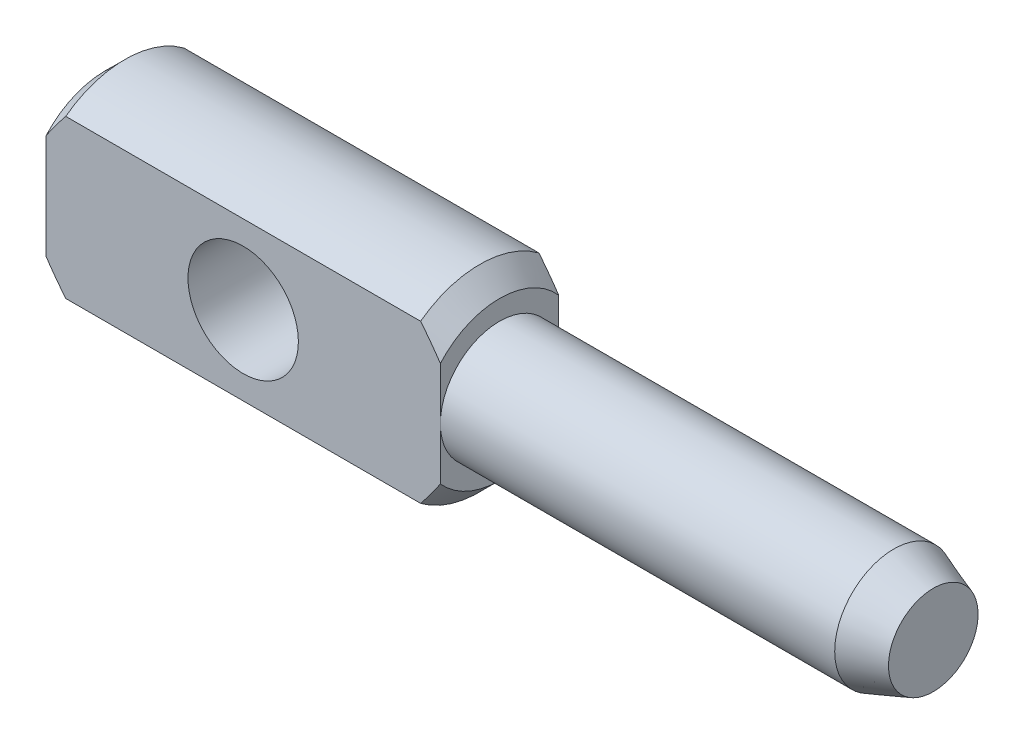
ISO-10303-21;
HEADER;
FILE_DESCRIPTION(('STEP AP214'),'2;1');
FILE_NAME('part.step','',(''),(''),'','','');
FILE_SCHEMA(('AUTOMOTIVE_DESIGN { 1 0 10303 214 1 1 1 1 }'));
ENDSEC;
DATA;
#1=APPLICATION_CONTEXT('core data for automotive mechanical design processes');
#2=APPLICATION_PROTOCOL_DEFINITION('international standard','automotive_design',2000,#1);
#3=PRODUCT_CONTEXT('',#1,'mechanical');
#4=PRODUCT('Part','Part','',(#3));
#5=PRODUCT_RELATED_PRODUCT_CATEGORY('part','',(#4));
#6=PRODUCT_DEFINITION_FORMATION('','',#4);
#7=PRODUCT_DEFINITION_CONTEXT('part definition',#1,'design');
#8=PRODUCT_DEFINITION('design','',#6,#7);
#9=PRODUCT_DEFINITION_SHAPE('','',#8);
#10=(LENGTH_UNIT() NAMED_UNIT(*) SI_UNIT(.MILLI.,.METRE.));
#11=(NAMED_UNIT(*) PLANE_ANGLE_UNIT() SI_UNIT($,.RADIAN.));
#12=(NAMED_UNIT(*) SI_UNIT($,.STERADIAN.) SOLID_ANGLE_UNIT());
#13=UNCERTAINTY_MEASURE_WITH_UNIT(LENGTH_MEASURE(1.E-05),#10,'distance_accuracy_value','');
#14=(GEOMETRIC_REPRESENTATION_CONTEXT(3) GLOBAL_UNCERTAINTY_ASSIGNED_CONTEXT((#13)) GLOBAL_UNIT_ASSIGNED_CONTEXT((#10,
#11,#12)) REPRESENTATION_CONTEXT('',''));
#15=CARTESIAN_POINT('',(0.,0.,0.));
#16=DIRECTION('',(0.,0.,1.));
#17=DIRECTION('',(1.,0.,0.));
#18=AXIS2_PLACEMENT_3D('',#15,#16,#17);
#19=CARTESIAN_POINT('',(0.,0.,0.));
#20=DIRECTION('',(1.,0.,0.));
#21=DIRECTION('',(0.,0.,-1.));
#22=AXIS2_PLACEMENT_3D('',#19,#20,#21);
#23=PLANE('',#22);
#24=DIRECTION('',(0.,1.,0.));
#25=VECTOR('',#24,1.);
#26=CARTESIAN_POINT('',(0.,-2.5,1.5));
#27=LINE('',#26,#25);
#28=CARTESIAN_POINT('',(0.,-1.32287565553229,1.5));
#29=VERTEX_POINT('',#28);
#30=CARTESIAN_POINT('',(0.,1.3228756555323,1.5));
#31=VERTEX_POINT('',#30);
#32=EDGE_CURVE('E116',#29,#31,#27,.T.);
#33=ORIENTED_EDGE('',*,*,#32,.T.);
#34=CARTESIAN_POINT('',(0.,0.,0.));
#35=DIRECTION('',(-1.,0.,0.));
#36=DIRECTION('',(0.,0.,1.));
#37=AXIS2_PLACEMENT_3D('',#34,#35,#36);
#38=CIRCLE('',#37,2.);
#39=CARTESIAN_POINT('',(0.,1.3228756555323,-1.5));
#40=VERTEX_POINT('',#39);
#41=EDGE_CURVE('E12',#31,#40,#38,.T.);
#42=ORIENTED_EDGE('',*,*,#41,.T.);
#43=DIRECTION('',(0.,-1.,0.));
#44=VECTOR('',#43,1.);
#45=CARTESIAN_POINT('',(0.,-2.5,-1.5));
#46=LINE('',#45,#44);
#47=CARTESIAN_POINT('',(0.,-1.3228756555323,-1.5));
#48=VERTEX_POINT('',#47);
#49=EDGE_CURVE('E104',#40,#48,#46,.T.);
#50=ORIENTED_EDGE('',*,*,#49,.T.);
#51=EDGE_CURVE('E42',#48,#29,#38,.T.);
#52=ORIENTED_EDGE('',*,*,#51,.T.);
#53=EDGE_LOOP('',(#33,#42,#50,#52));
#54=FACE_BOUND('',#53,.T.);
#55=ADVANCED_FACE('F35',(#54),#23,.F.);
#56=CARTESIAN_POINT('',(0.5,0.,0.));
#57=DIRECTION('',(1.,0.,0.));
#58=DIRECTION('',(0.,0.,-1.));
#59=AXIS2_PLACEMENT_3D('',#56,#57,#58);
#60=CONICAL_SURFACE('',#59,2.5,0.785398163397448);
#61=CARTESIAN_POINT('',(3.51516268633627,5.30726101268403,1.5));
#62=CARTESIAN_POINT('',(3.41129820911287,5.19932456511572,1.5));
#63=CARTESIAN_POINT('',(3.30755186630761,5.09127425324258,1.5));
#64=CARTESIAN_POINT('',(3.10035188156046,4.87489153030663,1.5));
#65=CARTESIAN_POINT('',(2.9968982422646,4.76655911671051,1.5));
#66=CARTESIAN_POINT('',(2.68699795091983,4.4409908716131,1.5));
#67=CARTESIAN_POINT('',(2.48107825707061,4.22325282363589,1.5));
#68=CARTESIAN_POINT('',(2.07285908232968,3.78735533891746,1.5));
#69=CARTESIAN_POINT('',(1.87054417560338,3.56921041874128,1.5));
#70=CARTESIAN_POINT('',(1.5697300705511,3.2395911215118,1.5));
#71=CARTESIAN_POINT('',(1.4699081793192,3.12932498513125,1.5));
#72=CARTESIAN_POINT('',(1.27145616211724,2.9077267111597,1.5));
#73=CARTESIAN_POINT('',(1.17282600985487,2.79639459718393,1.5));
#74=CARTESIAN_POINT('',(1.00543413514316,2.60463800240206,1.5));
#75=CARTESIAN_POINT('',(0.936267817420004,2.52456708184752,1.5));
#76=CARTESIAN_POINT('',(0.798998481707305,2.36350815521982,1.5));
#77=CARTESIAN_POINT('',(0.7308955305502,2.28252009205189,1.5));
#78=CARTESIAN_POINT('',(0.595778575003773,2.11900885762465,1.5));
#79=CARTESIAN_POINT('',(0.528771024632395,2.03648033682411,1.5));
#80=CARTESIAN_POINT('',(0.396669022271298,1.86991949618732,1.5));
#81=CARTESIAN_POINT('',(0.331574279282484,1.78588740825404,1.5));
#82=CARTESIAN_POINT('',(0.203522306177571,1.6151567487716,1.5));
#83=CARTESIAN_POINT('',(0.140586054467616,1.52844234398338,1.5));
#84=CARTESIAN_POINT('',(0.0185337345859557,1.3522307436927,1.5));
#85=CARTESIAN_POINT('',(-0.0405793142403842,1.2627314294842,1.5));
#86=CARTESIAN_POINT('',(-0.152775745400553,1.08045990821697,1.5));
#87=CARTESIAN_POINT('',(-0.205881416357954,0.987701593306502,1.5));
#88=CARTESIAN_POINT('',(-0.303093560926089,0.79758711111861,1.5));
#89=CARTESIAN_POINT('',(-0.347216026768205,0.700239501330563,1.5));
#90=CARTESIAN_POINT('',(-0.403299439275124,0.549256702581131,1.5));
#91=CARTESIAN_POINT('',(-0.42043059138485,0.497552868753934,1.5));
#92=CARTESIAN_POINT('',(-0.450219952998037,0.392856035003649,1.5));
#93=CARTESIAN_POINT('',(-0.462878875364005,0.339863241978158,1.5));
#94=CARTESIAN_POINT('',(-0.482866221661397,0.233262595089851,1.5));
#95=CARTESIAN_POINT('',(-0.490232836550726,0.179662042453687,1.5));
#96=CARTESIAN_POINT('',(-0.499231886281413,0.0719778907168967,1.5));
#97=CARTESIAN_POINT('',(-0.500865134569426,0.017894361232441,1.5));
#98=CARTESIAN_POINT('',(-0.498261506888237,-0.0902887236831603,1.5));
#99=CARTESIAN_POINT('',(-0.494007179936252,-0.144387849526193,1.5));
#100=CARTESIAN_POINT('',(-0.479938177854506,-0.25185285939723,1.5));
#101=CARTESIAN_POINT('',(-0.470122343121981,-0.305218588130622,1.5));
#102=CARTESIAN_POINT('',(-0.445517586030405,-0.411215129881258,1.5));
#103=CARTESIAN_POINT('',(-0.430689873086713,-0.463836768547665,1.5));
#104=CARTESIAN_POINT('',(-0.396911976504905,-0.567720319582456,1.5));
#105=CARTESIAN_POINT('',(-0.377961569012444,-0.618982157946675,1.5));
#106=CARTESIAN_POINT('',(-0.332968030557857,-0.729371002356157,1.5));
#107=CARTESIAN_POINT('',(-0.306261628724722,-0.788225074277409,1.5));
#108=CARTESIAN_POINT('',(-0.249281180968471,-0.904194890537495,1.5));
#109=CARTESIAN_POINT('',(-0.219005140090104,-0.961309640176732,1.5));
#110=CARTESIAN_POINT('',(-0.155680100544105,-1.07410361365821,1.5));
#111=CARTESIAN_POINT('',(-0.122626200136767,-1.12978006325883,1.5));
#112=CARTESIAN_POINT('',(-0.0544093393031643,-1.23983114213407,1.5));
#113=CARTESIAN_POINT('',(-0.0192459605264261,-1.29420551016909,1.5));
#114=CARTESIAN_POINT('',(0.0894442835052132,-1.45683639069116,1.5));
#115=CARTESIAN_POINT('',(0.16547784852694,-1.56341309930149,1.5));
#116=CARTESIAN_POINT('',(0.321582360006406,-1.77330825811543,1.5));
#117=CARTESIAN_POINT('',(0.401648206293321,-1.87663056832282,1.5));
#118=CARTESIAN_POINT('',(0.543618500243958,-2.05477163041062,1.5));
#119=CARTESIAN_POINT('',(0.604899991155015,-2.13008914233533,1.5));
#120=CARTESIAN_POINT('',(0.728642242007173,-2.27974903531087,1.5));
#121=CARTESIAN_POINT('',(0.791103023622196,-2.354091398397,1.5));
#122=CARTESIAN_POINT('',(0.979863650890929,-2.57598067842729,1.5));
#123=CARTESIAN_POINT('',(1.10752448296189,-2.72236841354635,1.5));
#124=CARTESIAN_POINT('',(1.36529460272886,-3.01325594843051,1.5));
#125=CARTESIAN_POINT('',(1.49540651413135,-3.15775340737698,1.5));
#126=CARTESIAN_POINT('',(1.75719842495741,-3.44529728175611,1.5));
#127=CARTESIAN_POINT('',(1.88887829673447,-3.58834381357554,1.5));
#128=CARTESIAN_POINT('',(2.14434448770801,-3.86368160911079,1.5));
#129=CARTESIAN_POINT('',(2.26805709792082,-3.99604140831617,1.5));
#130=CARTESIAN_POINT('',(2.51621722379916,-4.2600760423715,1.5));
#131=CARTESIAN_POINT('',(2.64066475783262,-4.3917508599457,1.5));
#132=CARTESIAN_POINT('',(2.88987319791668,-4.65430649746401,1.5));
#133=CARTESIAN_POINT('',(3.0146329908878,-4.7851883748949,1.5));
#134=CARTESIAN_POINT('',(3.26459391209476,-5.04652082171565,1.5));
#135=CARTESIAN_POINT('',(3.38979502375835,-5.17697140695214,1.5));
#136=CARTESIAN_POINT('',(3.51516268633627,-5.30726101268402,1.5));
#137=B_SPLINE_CURVE_WITH_KNOTS('',3,(#61,#62,#63,#64,#65,#66,#67,#68,#69,#70,#71,#72,#73,#74,
#75,#76,#77,#78,#79,#80,#81,#82,#83,#84,#85,#86,#87,#88,#89,#90,#91,#92,#93,#94,#95,#96,#97,#98,
#99,#100,#101,#102,#103,#104,#105,#106,#107,#108,#109,#110,#111,#112,#113,#114,#115,#116,#117,
#118,#119,#120,#121,#122,#123,#124,#125,#126,#127,#128,#129,#130,#131,#132,#133,#134,#135,#136),
.UNSPECIFIED.,.F.,.F.,(4,2,2,2,2,2,2,2,2,2,2,2,2,2,2,2,2,2,2,2,2,2,2,2,2,2,2,2,2,2,2,2,2,2,2,2,
2,4),(0.,0.449380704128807,0.898765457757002,1.79782163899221,2.69035548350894,3.13656410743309,
3.58276286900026,3.90017989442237,4.21761678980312,4.53651459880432,4.85536363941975,
5.1767345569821,5.49835625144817,5.81874255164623,6.13855340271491,6.30179762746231,
6.46501581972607,6.6270440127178,6.78904921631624,6.95153563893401,7.11405595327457,
7.27786408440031,7.44168111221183,7.6354096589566,7.82924699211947,8.02343385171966,
8.21765935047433,8.61022782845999,9.00231166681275,9.29359301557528,9.58487972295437,
10.1675355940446,10.7508552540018,11.3341277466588,11.8776457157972,12.4211773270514,
12.9636295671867,13.5060616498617),.UNSPECIFIED.);
#138=CARTESIAN_POINT('',(0.5,2.,1.5));
#139=VERTEX_POINT('',#138);
#140=EDGE_CURVE('E173',#139,#31,#137,.T.);
#141=ORIENTED_EDGE('',*,*,#140,.F.);
#142=CARTESIAN_POINT('',(0.5,0.,0.));
#143=DIRECTION('',(-1.,0.,0.));
#144=DIRECTION('',(0.,0.,1.));
#145=AXIS2_PLACEMENT_3D('',#142,#143,#144);
#146=CIRCLE('',#145,2.5);
#147=CARTESIAN_POINT('',(0.5,2.,-1.5));
#148=VERTEX_POINT('',#147);
#149=EDGE_CURVE('E123',#139,#148,#146,.T.);
#150=ORIENTED_EDGE('',*,*,#149,.T.);
#151=CARTESIAN_POINT('',(3.51516268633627,-5.30726101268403,-1.5));
#152=CARTESIAN_POINT('',(3.41129820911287,-5.19932456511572,-1.5));
#153=CARTESIAN_POINT('',(3.30755186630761,-5.09127425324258,-1.5));
#154=CARTESIAN_POINT('',(3.10035188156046,-4.87489153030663,-1.5));
#155=CARTESIAN_POINT('',(2.9968982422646,-4.76655911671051,-1.5));
#156=CARTESIAN_POINT('',(2.68699795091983,-4.4409908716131,-1.5));
#157=CARTESIAN_POINT('',(2.48107825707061,-4.22325282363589,-1.5));
#158=CARTESIAN_POINT('',(2.07285908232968,-3.78735533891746,-1.5));
#159=CARTESIAN_POINT('',(1.87054417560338,-3.56921041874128,-1.5));
#160=CARTESIAN_POINT('',(1.5697300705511,-3.2395911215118,-1.5));
#161=CARTESIAN_POINT('',(1.4699081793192,-3.12932498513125,-1.5));
#162=CARTESIAN_POINT('',(1.27145616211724,-2.9077267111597,-1.5));
#163=CARTESIAN_POINT('',(1.17282600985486,-2.79639459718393,-1.5));
#164=CARTESIAN_POINT('',(1.00543413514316,-2.60463800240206,-1.5));
#165=CARTESIAN_POINT('',(0.936267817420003,-2.52456708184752,-1.5));
#166=CARTESIAN_POINT('',(0.798998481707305,-2.36350815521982,-1.5));
#167=CARTESIAN_POINT('',(0.730895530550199,-2.28252009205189,-1.5));
#168=CARTESIAN_POINT('',(0.595778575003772,-2.11900885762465,-1.5));
#169=CARTESIAN_POINT('',(0.528771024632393,-2.03648033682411,-1.5));
#170=CARTESIAN_POINT('',(0.396669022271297,-1.86991949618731,-1.5));
#171=CARTESIAN_POINT('',(0.331574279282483,-1.78588740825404,-1.5));
#172=CARTESIAN_POINT('',(0.203522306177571,-1.6151567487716,-1.5));
#173=CARTESIAN_POINT('',(0.140586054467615,-1.52844234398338,-1.5));
#174=CARTESIAN_POINT('',(0.0185337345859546,-1.3522307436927,-1.5));
#175=CARTESIAN_POINT('',(-0.0405793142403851,-1.2627314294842,-1.5));
#176=CARTESIAN_POINT('',(-0.152775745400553,-1.08045990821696,-1.5));
#177=CARTESIAN_POINT('',(-0.205881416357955,-0.987701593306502,-1.5));
#178=CARTESIAN_POINT('',(-0.303093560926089,-0.79758711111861,-1.5));
#179=CARTESIAN_POINT('',(-0.347216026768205,-0.700239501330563,-1.5));
#180=CARTESIAN_POINT('',(-0.403299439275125,-0.549256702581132,-1.5));
#181=CARTESIAN_POINT('',(-0.42043059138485,-0.497552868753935,-1.5));
#182=CARTESIAN_POINT('',(-0.450219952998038,-0.392856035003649,-1.5));
#183=CARTESIAN_POINT('',(-0.462878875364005,-0.339863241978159,-1.5));
#184=CARTESIAN_POINT('',(-0.482866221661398,-0.233262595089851,-1.5));
#185=CARTESIAN_POINT('',(-0.490232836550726,-0.179662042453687,-1.5));
#186=CARTESIAN_POINT('',(-0.499231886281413,-0.0719778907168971,-1.5));
#187=CARTESIAN_POINT('',(-0.500865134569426,-0.0178943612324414,-1.5));
#188=CARTESIAN_POINT('',(-0.498261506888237,0.0902887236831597,-1.5));
#189=CARTESIAN_POINT('',(-0.494007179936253,0.144387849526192,-1.5));
#190=CARTESIAN_POINT('',(-0.479938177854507,0.251852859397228,-1.5));
#191=CARTESIAN_POINT('',(-0.470122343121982,0.30521858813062,-1.5));
#192=CARTESIAN_POINT('',(-0.445517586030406,0.411215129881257,-1.5));
#193=CARTESIAN_POINT('',(-0.430689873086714,0.463836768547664,-1.5));
#194=CARTESIAN_POINT('',(-0.396911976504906,0.567720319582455,-1.5));
#195=CARTESIAN_POINT('',(-0.377961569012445,0.618982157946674,-1.5));
#196=CARTESIAN_POINT('',(-0.332968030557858,0.729371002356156,-1.5));
#197=CARTESIAN_POINT('',(-0.306261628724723,0.788225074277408,-1.5));
#198=CARTESIAN_POINT('',(-0.249281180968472,0.904194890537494,-1.5));
#199=CARTESIAN_POINT('',(-0.219005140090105,0.961309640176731,-1.5));
#200=CARTESIAN_POINT('',(-0.155680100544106,1.07410361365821,-1.5));
#201=CARTESIAN_POINT('',(-0.122626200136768,1.12978006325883,-1.5));
#202=CARTESIAN_POINT('',(-0.0544093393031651,1.23983114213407,-1.5));
#203=CARTESIAN_POINT('',(-0.0192459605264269,1.29420551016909,-1.5));
#204=CARTESIAN_POINT('',(0.0894442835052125,1.45683639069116,-1.5));
#205=CARTESIAN_POINT('',(0.16547784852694,1.56341309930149,-1.5));
#206=CARTESIAN_POINT('',(0.321582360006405,1.77330825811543,-1.5));
#207=CARTESIAN_POINT('',(0.401648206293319,1.87663056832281,-1.5));
#208=CARTESIAN_POINT('',(0.543618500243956,2.05477163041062,-1.5));
#209=CARTESIAN_POINT('',(0.604899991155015,2.13008914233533,-1.5));
#210=CARTESIAN_POINT('',(0.728642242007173,2.27974903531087,-1.5));
#211=CARTESIAN_POINT('',(0.791103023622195,2.354091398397,-1.5));
#212=CARTESIAN_POINT('',(0.979863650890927,2.57598067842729,-1.5));
#213=CARTESIAN_POINT('',(1.10752448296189,2.72236841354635,-1.5));
#214=CARTESIAN_POINT('',(1.36529460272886,3.01325594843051,-1.5));
#215=CARTESIAN_POINT('',(1.49540651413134,3.15775340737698,-1.5));
#216=CARTESIAN_POINT('',(1.75719842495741,3.44529728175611,-1.5));
#217=CARTESIAN_POINT('',(1.88887829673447,3.58834381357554,-1.5));
#218=CARTESIAN_POINT('',(2.14434448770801,3.86368160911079,-1.5));
#219=CARTESIAN_POINT('',(2.26805709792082,3.99604140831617,-1.5));
#220=CARTESIAN_POINT('',(2.51621722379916,4.2600760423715,-1.5));
#221=CARTESIAN_POINT('',(2.64066475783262,4.3917508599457,-1.5));
#222=CARTESIAN_POINT('',(2.88987319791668,4.65430649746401,-1.5));
#223=CARTESIAN_POINT('',(3.0146329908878,4.7851883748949,-1.5));
#224=CARTESIAN_POINT('',(3.26459391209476,5.04652082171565,-1.5));
#225=CARTESIAN_POINT('',(3.38979502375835,5.17697140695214,-1.5));
#226=CARTESIAN_POINT('',(3.51516268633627,5.30726101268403,-1.5));
#227=B_SPLINE_CURVE_WITH_KNOTS('',3,(#151,#152,#153,#154,#155,#156,#157,#158,#159,#160,#161,
#162,#163,#164,#165,#166,#167,#168,#169,#170,#171,#172,#173,#174,#175,#176,#177,#178,#179,#180,
#181,#182,#183,#184,#185,#186,#187,#188,#189,#190,#191,#192,#193,#194,#195,#196,#197,#198,#199,
#200,#201,#202,#203,#204,#205,#206,#207,#208,#209,#210,#211,#212,#213,#214,#215,#216,#217,#218,
#219,#220,#221,#222,#223,#224,#225,#226),.UNSPECIFIED.,.F.,.F.,(4,2,2,2,2,2,2,2,2,2,2,2,2,2,2,2,
2,2,2,2,2,2,2,2,2,2,2,2,2,2,2,2,2,2,2,2,2,4),(0.,0.449380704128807,0.898765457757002,
1.79782163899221,2.69035548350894,3.13656410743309,3.58276286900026,3.90017989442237,
4.21761678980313,4.53651459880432,4.85536363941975,5.1767345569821,5.49835625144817,
5.81874255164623,6.13855340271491,6.30179762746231,6.46501581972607,6.6270440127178,
6.78904921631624,6.95153563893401,7.11405595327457,7.27786408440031,7.44168111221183,
7.6354096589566,7.82924699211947,8.02343385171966,8.21765935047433,8.61022782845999,
9.00231166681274,9.29359301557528,9.58487972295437,10.1675355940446,10.7508552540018,
11.3341277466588,11.8776457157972,12.4211773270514,12.9636295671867,13.5060616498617),.UNSPECIFIED.);
#228=EDGE_CURVE('E108',#40,#148,#227,.T.);
#229=ORIENTED_EDGE('',*,*,#228,.F.);
#230=ORIENTED_EDGE('',*,*,#41,.F.);
#231=EDGE_LOOP('',(#141,#150,#229,#230));
#232=FACE_BOUND('',#231,.T.);
#233=ADVANCED_FACE('F121',(#232),#60,.T.);
#234=CARTESIAN_POINT('',(0.5,-2.,1.5));
#235=VERTEX_POINT('',#234);
#236=EDGE_CURVE('E180',#29,#235,#137,.T.);
#237=ORIENTED_EDGE('',*,*,#236,.F.);
#238=ORIENTED_EDGE('',*,*,#51,.F.);
#239=CARTESIAN_POINT('',(0.5,-2.,-1.5));
#240=VERTEX_POINT('',#239);
#241=EDGE_CURVE('E111',#240,#48,#227,.T.);
#242=ORIENTED_EDGE('',*,*,#241,.F.);
#243=EDGE_CURVE('E202',#240,#235,#146,.T.);
#244=ORIENTED_EDGE('',*,*,#243,.T.);
#245=EDGE_LOOP('',(#237,#238,#242,#244));
#246=FACE_BOUND('',#245,.T.);
#247=ADVANCED_FACE('F169',(#246),#60,.T.);
#248=CARTESIAN_POINT('',(0.,0.,0.));
#249=DIRECTION('',(-1.,0.,0.));
#250=DIRECTION('',(0.,0.,1.));
#251=AXIS2_PLACEMENT_3D('',#248,#249,#250);
#252=CYLINDRICAL_SURFACE('',#251,2.5);
#253=CARTESIAN_POINT('',(9.5,0.,0.));
#254=DIRECTION('',(-1.,0.,0.));
#255=DIRECTION('',(0.,0.,1.));
#256=AXIS2_PLACEMENT_3D('',#253,#254,#255);
#257=CIRCLE('',#256,2.5);
#258=CARTESIAN_POINT('',(9.5,-2.,-1.5));
#259=VERTEX_POINT('',#258);
#260=CARTESIAN_POINT('',(9.4999999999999,-2.00000000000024,1.5));
#261=VERTEX_POINT('',#260);
#262=EDGE_CURVE('E200',#259,#261,#257,.T.);
#263=ORIENTED_EDGE('',*,*,#262,.T.);
#264=DIRECTION('',(-1.,0.,0.));
#265=VECTOR('',#264,1.);
#266=CARTESIAN_POINT('',(0.,-2.,1.5));
#267=LINE('',#266,#265);
#268=EDGE_CURVE('E182',#235,#261,#267,.F.);
#269=ORIENTED_EDGE('',*,*,#268,.F.);
#270=ORIENTED_EDGE('',*,*,#243,.F.);
#271=DIRECTION('',(-1.,0.,0.));
#272=VECTOR('',#271,1.);
#273=CARTESIAN_POINT('',(0.,-2.,-1.5));
#274=LINE('',#273,#272);
#275=EDGE_CURVE('E145',#259,#240,#274,.T.);
#276=ORIENTED_EDGE('',*,*,#275,.F.);
#277=EDGE_LOOP('',(#263,#269,#270,#276));
#278=FACE_BOUND('',#277,.T.);
#279=ADVANCED_FACE('F170',(#278),#252,.T.);
#280=DIRECTION('',(-1.,0.,0.));
#281=VECTOR('',#280,1.);
#282=CARTESIAN_POINT('',(0.,2.,-1.5));
#283=LINE('',#282,#281);
#284=CARTESIAN_POINT('',(9.4999999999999,2.00000000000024,-1.5));
#285=VERTEX_POINT('',#284);
#286=EDGE_CURVE('E125',#148,#285,#283,.F.);
#287=ORIENTED_EDGE('',*,*,#286,.F.);
#288=ORIENTED_EDGE('',*,*,#149,.F.);
#289=DIRECTION('',(-1.,0.,0.));
#290=VECTOR('',#289,1.);
#291=CARTESIAN_POINT('',(0.,2.,1.5));
#292=LINE('',#291,#290);
#293=CARTESIAN_POINT('',(9.5,2.,1.5));
#294=VERTEX_POINT('',#293);
#295=EDGE_CURVE('E179',#294,#139,#292,.T.);
#296=ORIENTED_EDGE('',*,*,#295,.F.);
#297=EDGE_CURVE('E201',#294,#285,#257,.T.);
#298=ORIENTED_EDGE('',*,*,#297,.T.);
#299=EDGE_LOOP('',(#287,#288,#296,#298));
#300=FACE_BOUND('',#299,.T.);
#301=ADVANCED_FACE('F230',(#300),#252,.T.);
#302=CARTESIAN_POINT('',(10.,0.,0.));
#303=DIRECTION('',(-1.,0.,0.));
#304=DIRECTION('',(0.,0.,1.));
#305=AXIS2_PLACEMENT_3D('',#302,#303,#304);
#306=CONICAL_SURFACE('',#305,2.,0.785398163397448);
#307=CARTESIAN_POINT('',(6.48483731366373,-5.30726101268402,1.5));
#308=CARTESIAN_POINT('',(6.58870179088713,-5.19932456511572,1.5));
#309=CARTESIAN_POINT('',(6.69244813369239,-5.09127425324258,1.5));
#310=CARTESIAN_POINT('',(6.89964811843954,-4.87489153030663,1.5));
#311=CARTESIAN_POINT('',(7.0031017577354,-4.7665591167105,1.5));
#312=CARTESIAN_POINT('',(7.31300204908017,-4.4409908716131,1.5));
#313=CARTESIAN_POINT('',(7.51892174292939,-4.22325282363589,1.5));
#314=CARTESIAN_POINT('',(7.92714091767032,-3.78735533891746,1.5));
#315=CARTESIAN_POINT('',(8.12945582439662,-3.56921041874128,1.5));
#316=CARTESIAN_POINT('',(8.4302699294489,-3.2395911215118,1.5));
#317=CARTESIAN_POINT('',(8.53009182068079,-3.12932498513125,1.5));
#318=CARTESIAN_POINT('',(8.72854383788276,-2.9077267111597,1.5));
#319=CARTESIAN_POINT('',(8.82717399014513,-2.79639459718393,1.5));
#320=CARTESIAN_POINT('',(8.99456586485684,-2.60463800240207,1.5));
#321=CARTESIAN_POINT('',(9.06373218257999,-2.52456708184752,1.5));
#322=CARTESIAN_POINT('',(9.20100151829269,-2.36350815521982,1.5));
#323=CARTESIAN_POINT('',(9.2691044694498,-2.28252009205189,1.5));
#324=CARTESIAN_POINT('',(9.40422142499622,-2.11900885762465,1.5));
#325=CARTESIAN_POINT('',(9.4712289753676,-2.03648033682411,1.5));
#326=CARTESIAN_POINT('',(9.6033309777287,-1.86991949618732,1.5));
#327=CARTESIAN_POINT('',(9.66842572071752,-1.78588740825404,1.5));
#328=CARTESIAN_POINT('',(9.79647769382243,-1.6151567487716,1.5));
#329=CARTESIAN_POINT('',(9.85941394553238,-1.52844234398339,1.5));
#330=CARTESIAN_POINT('',(9.98146626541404,-1.3522307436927,1.5));
#331=CARTESIAN_POINT('',(10.0405793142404,-1.26273142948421,1.5));
#332=CARTESIAN_POINT('',(10.1527757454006,-1.08045990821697,1.5));
#333=CARTESIAN_POINT('',(10.205881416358,-0.987701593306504,1.5));
#334=CARTESIAN_POINT('',(10.3030935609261,-0.797587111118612,1.5));
#335=CARTESIAN_POINT('',(10.3472160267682,-0.700239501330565,1.5));
#336=CARTESIAN_POINT('',(10.4032994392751,-0.549256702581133,1.5));
#337=CARTESIAN_POINT('',(10.4204305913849,-0.497552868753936,1.5));
#338=CARTESIAN_POINT('',(10.450219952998,-0.39285603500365,1.5));
#339=CARTESIAN_POINT('',(10.462878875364,-0.339863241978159,1.5));
#340=CARTESIAN_POINT('',(10.4828662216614,-0.233262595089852,1.5));
#341=CARTESIAN_POINT('',(10.4902328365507,-0.179662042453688,1.5));
#342=CARTESIAN_POINT('',(10.4992318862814,-0.071977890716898,1.5));
#343=CARTESIAN_POINT('',(10.5008651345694,-0.0178943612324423,1.5));
#344=CARTESIAN_POINT('',(10.4982615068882,0.0902887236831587,1.5));
#345=CARTESIAN_POINT('',(10.4940071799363,0.144387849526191,1.5));
#346=CARTESIAN_POINT('',(10.4799381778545,0.251852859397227,1.5));
#347=CARTESIAN_POINT('',(10.470122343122,0.305218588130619,1.5));
#348=CARTESIAN_POINT('',(10.4455175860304,0.411215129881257,1.5));
#349=CARTESIAN_POINT('',(10.4306898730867,0.463836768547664,1.5));
#350=CARTESIAN_POINT('',(10.3969119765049,0.567720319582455,1.5));
#351=CARTESIAN_POINT('',(10.3779615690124,0.618982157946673,1.5));
#352=CARTESIAN_POINT('',(10.3329680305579,0.729371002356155,1.5));
#353=CARTESIAN_POINT('',(10.3062616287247,0.788225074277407,1.5));
#354=CARTESIAN_POINT('',(10.2492811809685,0.904194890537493,1.5));
#355=CARTESIAN_POINT('',(10.2190051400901,0.96130964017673,1.5));
#356=CARTESIAN_POINT('',(10.1556801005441,1.07410361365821,1.5));
#357=CARTESIAN_POINT('',(10.1226262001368,1.12978006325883,1.5));
#358=CARTESIAN_POINT('',(10.0544093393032,1.23983114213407,1.5));
#359=CARTESIAN_POINT('',(10.0192459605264,1.29420551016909,1.5));
#360=CARTESIAN_POINT('',(9.91055571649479,1.45683639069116,1.5));
#361=CARTESIAN_POINT('',(9.83452215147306,1.56341309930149,1.5));
#362=CARTESIAN_POINT('',(9.6784176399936,1.77330825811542,1.5));
#363=CARTESIAN_POINT('',(9.59835179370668,1.87663056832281,1.5));
#364=CARTESIAN_POINT('',(9.45638149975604,2.05477163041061,1.5));
#365=CARTESIAN_POINT('',(9.39510000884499,2.13008914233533,1.5));
#366=CARTESIAN_POINT('',(9.27135775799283,2.27974903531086,1.5));
#367=CARTESIAN_POINT('',(9.20889697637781,2.35409139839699,1.5));
#368=CARTESIAN_POINT('',(9.02013634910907,2.57598067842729,1.5));
#369=CARTESIAN_POINT('',(8.89247551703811,2.72236841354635,1.5));
#370=CARTESIAN_POINT('',(8.63470539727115,3.0132559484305,1.5));
#371=CARTESIAN_POINT('',(8.50459348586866,3.15775340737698,1.5));
#372=CARTESIAN_POINT('',(8.2428015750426,3.4452972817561,1.5));
#373=CARTESIAN_POINT('',(8.11112170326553,3.58834381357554,1.5));
#374=CARTESIAN_POINT('',(7.85565551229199,3.86368160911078,1.5));
#375=CARTESIAN_POINT('',(7.73194290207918,3.99604140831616,1.5));
#376=CARTESIAN_POINT('',(7.48378277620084,4.2600760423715,1.5));
#377=CARTESIAN_POINT('',(7.35933524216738,4.3917508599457,1.5));
#378=CARTESIAN_POINT('',(7.11012680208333,4.654306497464,1.5));
#379=CARTESIAN_POINT('',(6.9853670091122,4.7851883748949,1.5));
#380=CARTESIAN_POINT('',(6.73540608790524,5.04652082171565,1.5));
#381=CARTESIAN_POINT('',(6.61020497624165,5.17697140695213,1.5));
#382=CARTESIAN_POINT('',(6.48483731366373,5.30726101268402,1.5));
#383=B_SPLINE_CURVE_WITH_KNOTS('',3,(#307,#308,#309,#310,#311,#312,#313,#314,#315,#316,#317,
#318,#319,#320,#321,#322,#323,#324,#325,#326,#327,#328,#329,#330,#331,#332,#333,#334,#335,#336,
#337,#338,#339,#340,#341,#342,#343,#344,#345,#346,#347,#348,#349,#350,#351,#352,#353,#354,#355,
#356,#357,#358,#359,#360,#361,#362,#363,#364,#365,#366,#367,#368,#369,#370,#371,#372,#373,#374,
#375,#376,#377,#378,#379,#380,#381,#382),.UNSPECIFIED.,.F.,.F.,(4,2,2,2,2,2,2,2,2,2,2,2,2,2,2,2,
2,2,2,2,2,2,2,2,2,2,2,2,2,2,2,2,2,2,2,2,2,4),(0.,0.449380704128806,0.898765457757,
1.79782163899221,2.69035548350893,3.13656410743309,3.58276286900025,3.90017989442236,
4.21761678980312,4.53651459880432,4.85536363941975,5.17673455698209,5.49835625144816,
5.81874255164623,6.1385534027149,6.3017976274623,6.46501581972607,6.6270440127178,
6.78904921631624,6.951535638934,7.11405595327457,7.27786408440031,7.44168111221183,
7.6354096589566,7.82924699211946,8.02343385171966,8.21765935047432,8.61022782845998,
9.00231166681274,9.29359301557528,9.58487972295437,10.1675355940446,10.7508552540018,
11.3341277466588,11.8776457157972,12.4211773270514,12.9636295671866,13.5060616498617),.UNSPECIFIED.);
#384=CARTESIAN_POINT('',(10.,-1.32287565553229,1.5));
#385=VERTEX_POINT('',#384);
#386=EDGE_CURVE('E185',#261,#385,#383,.T.);
#387=ORIENTED_EDGE('',*,*,#386,.F.);
#388=ORIENTED_EDGE('',*,*,#262,.F.);
#389=CARTESIAN_POINT('',(6.48483731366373,5.30726101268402,-1.5));
#390=CARTESIAN_POINT('',(6.58870179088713,5.19932456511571,-1.5));
#391=CARTESIAN_POINT('',(6.69244813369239,5.09127425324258,-1.5));
#392=CARTESIAN_POINT('',(6.89964811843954,4.87489153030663,-1.5));
#393=CARTESIAN_POINT('',(7.0031017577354,4.7665591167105,-1.5));
#394=CARTESIAN_POINT('',(7.31300204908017,4.4409908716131,-1.5));
#395=CARTESIAN_POINT('',(7.51892174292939,4.22325282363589,-1.5));
#396=CARTESIAN_POINT('',(7.92714091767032,3.78735533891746,-1.5));
#397=CARTESIAN_POINT('',(8.12945582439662,3.56921041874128,-1.5));
#398=CARTESIAN_POINT('',(8.4302699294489,3.2395911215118,-1.5));
#399=CARTESIAN_POINT('',(8.5300918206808,3.12932498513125,-1.5));
#400=CARTESIAN_POINT('',(8.72854383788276,2.9077267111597,-1.5));
#401=CARTESIAN_POINT('',(8.82717399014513,2.79639459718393,-1.5));
#402=CARTESIAN_POINT('',(8.99456586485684,2.60463800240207,-1.5));
#403=CARTESIAN_POINT('',(9.06373218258,2.52456708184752,-1.5));
#404=CARTESIAN_POINT('',(9.20100151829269,2.36350815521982,-1.5));
#405=CARTESIAN_POINT('',(9.2691044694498,2.28252009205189,-1.5));
#406=CARTESIAN_POINT('',(9.40422142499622,2.11900885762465,-1.5));
#407=CARTESIAN_POINT('',(9.4712289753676,2.03648033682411,-1.5));
#408=CARTESIAN_POINT('',(9.6033309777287,1.86991949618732,-1.5));
#409=CARTESIAN_POINT('',(9.66842572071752,1.78588740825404,-1.5));
#410=CARTESIAN_POINT('',(9.79647769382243,1.6151567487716,-1.5));
#411=CARTESIAN_POINT('',(9.85941394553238,1.52844234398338,-1.5));
#412=CARTESIAN_POINT('',(9.98146626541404,1.3522307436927,-1.5));
#413=CARTESIAN_POINT('',(10.0405793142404,1.2627314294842,-1.5));
#414=CARTESIAN_POINT('',(10.1527757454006,1.08045990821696,-1.5));
#415=CARTESIAN_POINT('',(10.205881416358,0.987701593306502,-1.5));
#416=CARTESIAN_POINT('',(10.3030935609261,0.797587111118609,-1.5));
#417=CARTESIAN_POINT('',(10.3472160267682,0.700239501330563,-1.5));
#418=CARTESIAN_POINT('',(10.4032994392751,0.549256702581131,-1.5));
#419=CARTESIAN_POINT('',(10.4204305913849,0.497552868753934,-1.5));
#420=CARTESIAN_POINT('',(10.450219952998,0.392856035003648,-1.5));
#421=CARTESIAN_POINT('',(10.462878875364,0.339863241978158,-1.5));
#422=CARTESIAN_POINT('',(10.4828662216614,0.233262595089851,-1.5));
#423=CARTESIAN_POINT('',(10.4902328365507,0.179662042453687,-1.5));
#424=CARTESIAN_POINT('',(10.4992318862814,0.0719778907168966,-1.5));
#425=CARTESIAN_POINT('',(10.5008651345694,0.0178943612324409,-1.5));
#426=CARTESIAN_POINT('',(10.4982615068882,-0.0902887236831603,-1.5));
#427=CARTESIAN_POINT('',(10.4940071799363,-0.144387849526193,-1.5));
#428=CARTESIAN_POINT('',(10.4799381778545,-0.25185285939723,-1.5));
#429=CARTESIAN_POINT('',(10.470122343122,-0.305218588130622,-1.5));
#430=CARTESIAN_POINT('',(10.4455175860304,-0.411215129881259,-1.5));
#431=CARTESIAN_POINT('',(10.4306898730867,-0.463836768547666,-1.5));
#432=CARTESIAN_POINT('',(10.3969119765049,-0.567720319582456,-1.5));
#433=CARTESIAN_POINT('',(10.3779615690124,-0.618982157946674,-1.5));
#434=CARTESIAN_POINT('',(10.3329680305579,-0.729371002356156,-1.5));
#435=CARTESIAN_POINT('',(10.3062616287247,-0.788225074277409,-1.5));
#436=CARTESIAN_POINT('',(10.2492811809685,-0.904194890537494,-1.5));
#437=CARTESIAN_POINT('',(10.2190051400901,-0.961309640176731,-1.5));
#438=CARTESIAN_POINT('',(10.1556801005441,-1.07410361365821,-1.5));
#439=CARTESIAN_POINT('',(10.1226262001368,-1.12978006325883,-1.5));
#440=CARTESIAN_POINT('',(10.0544093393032,-1.23983114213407,-1.5));
#441=CARTESIAN_POINT('',(10.0192459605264,-1.29420551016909,-1.5));
#442=CARTESIAN_POINT('',(9.91055571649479,-1.45683639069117,-1.5));
#443=CARTESIAN_POINT('',(9.83452215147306,-1.56341309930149,-1.5));
#444=CARTESIAN_POINT('',(9.67841763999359,-1.77330825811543,-1.5));
#445=CARTESIAN_POINT('',(9.59835179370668,-1.87663056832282,-1.5));
#446=CARTESIAN_POINT('',(9.45638149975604,-2.05477163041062,-1.5));
#447=CARTESIAN_POINT('',(9.39510000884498,-2.13008914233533,-1.5));
#448=CARTESIAN_POINT('',(9.27135775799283,-2.27974903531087,-1.5));
#449=CARTESIAN_POINT('',(9.2088969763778,-2.354091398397,-1.5));
#450=CARTESIAN_POINT('',(9.02013634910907,-2.57598067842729,-1.5));
#451=CARTESIAN_POINT('',(8.89247551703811,-2.72236841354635,-1.5));
#452=CARTESIAN_POINT('',(8.63470539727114,-3.0132559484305,-1.5));
#453=CARTESIAN_POINT('',(8.50459348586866,-3.15775340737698,-1.5));
#454=CARTESIAN_POINT('',(8.24280157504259,-3.44529728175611,-1.5));
#455=CARTESIAN_POINT('',(8.11112170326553,-3.58834381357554,-1.5));
#456=CARTESIAN_POINT('',(7.85565551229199,-3.86368160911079,-1.5));
#457=CARTESIAN_POINT('',(7.73194290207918,-3.99604140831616,-1.5));
#458=CARTESIAN_POINT('',(7.48378277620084,-4.2600760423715,-1.5));
#459=CARTESIAN_POINT('',(7.35933524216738,-4.3917508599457,-1.5));
#460=CARTESIAN_POINT('',(7.11012680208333,-4.654306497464,-1.5));
#461=CARTESIAN_POINT('',(6.9853670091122,-4.7851883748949,-1.5));
#462=CARTESIAN_POINT('',(6.73540608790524,-5.04652082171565,-1.5));
#463=CARTESIAN_POINT('',(6.61020497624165,-5.17697140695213,-1.5));
#464=CARTESIAN_POINT('',(6.48483731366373,-5.30726101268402,-1.5));
#465=B_SPLINE_CURVE_WITH_KNOTS('',3,(#389,#390,#391,#392,#393,#394,#395,#396,#397,#398,#399,
#400,#401,#402,#403,#404,#405,#406,#407,#408,#409,#410,#411,#412,#413,#414,#415,#416,#417,#418,
#419,#420,#421,#422,#423,#424,#425,#426,#427,#428,#429,#430,#431,#432,#433,#434,#435,#436,#437,
#438,#439,#440,#441,#442,#443,#444,#445,#446,#447,#448,#449,#450,#451,#452,#453,#454,#455,#456,
#457,#458,#459,#460,#461,#462,#463,#464),.UNSPECIFIED.,.F.,.F.,(4,2,2,2,2,2,2,2,2,2,2,2,2,2,2,2,
2,2,2,2,2,2,2,2,2,2,2,2,2,2,2,2,2,2,2,2,2,4),(0.,0.449380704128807,0.898765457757,
1.79782163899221,2.69035548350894,3.13656410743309,3.58276286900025,3.90017989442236,
4.21761678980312,4.53651459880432,4.85536363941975,5.1767345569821,5.49835625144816,
5.81874255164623,6.1385534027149,6.30179762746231,6.46501581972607,6.6270440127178,
6.78904921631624,6.951535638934,7.11405595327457,7.27786408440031,7.44168111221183,
7.6354096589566,7.82924699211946,8.02343385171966,8.21765935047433,8.61022782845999,
9.00231166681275,9.29359301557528,9.58487972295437,10.1675355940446,10.7508552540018,
11.3341277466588,11.8776457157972,12.4211773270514,12.9636295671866,13.5060616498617),.UNSPECIFIED.);
#466=CARTESIAN_POINT('',(10.,-1.3228756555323,-1.5));
#467=VERTEX_POINT('',#466);
#468=EDGE_CURVE('E138',#467,#259,#465,.T.);
#469=ORIENTED_EDGE('',*,*,#468,.F.);
#470=CARTESIAN_POINT('',(10.,0.,0.));
#471=DIRECTION('',(-1.,0.,0.));
#472=DIRECTION('',(0.,0.,1.));
#473=AXIS2_PLACEMENT_3D('',#470,#471,#472);
#474=CIRCLE('',#473,2.);
#475=EDGE_CURVE('E196',#467,#385,#474,.T.);
#476=ORIENTED_EDGE('',*,*,#475,.T.);
#477=EDGE_LOOP('',(#387,#388,#469,#476));
#478=FACE_BOUND('',#477,.T.);
#479=ADVANCED_FACE('F147',(#478),#306,.T.);
#480=CARTESIAN_POINT('',(10.,1.32287565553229,1.5));
#481=VERTEX_POINT('',#480);
#482=EDGE_CURVE('E214',#481,#294,#383,.T.);
#483=ORIENTED_EDGE('',*,*,#482,.F.);
#484=CARTESIAN_POINT('',(10.,1.3228756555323,-1.5));
#485=VERTEX_POINT('',#484);
#486=EDGE_CURVE('E197',#481,#485,#474,.T.);
#487=ORIENTED_EDGE('',*,*,#486,.T.);
#488=EDGE_CURVE('E146',#285,#485,#465,.T.);
#489=ORIENTED_EDGE('',*,*,#488,.F.);
#490=ORIENTED_EDGE('',*,*,#297,.F.);
#491=EDGE_LOOP('',(#483,#487,#489,#490));
#492=FACE_BOUND('',#491,.T.);
#493=ADVANCED_FACE('F225',(#492),#306,.T.);
#494=CARTESIAN_POINT('',(10.,2.,0.));
#495=DIRECTION('',(-1.,0.,0.));
#496=DIRECTION('',(0.,0.,1.));
#497=AXIS2_PLACEMENT_3D('',#494,#495,#496);
#498=PLANE('',#497);
#499=DIRECTION('',(0.,1.,0.));
#500=VECTOR('',#499,1.);
#501=CARTESIAN_POINT('',(10.,2.,1.5));
#502=LINE('',#501,#500);
#503=CARTESIAN_POINT('',(10.,0.,1.5));
#504=VERTEX_POINT('',#503);
#505=EDGE_CURVE('E57',#385,#504,#502,.T.);
#506=ORIENTED_EDGE('',*,*,#505,.F.);
#507=ORIENTED_EDGE('',*,*,#475,.F.);
#508=DIRECTION('',(0.,-1.,0.));
#509=VECTOR('',#508,1.);
#510=CARTESIAN_POINT('',(10.,2.,-1.5));
#511=LINE('',#510,#509);
#512=CARTESIAN_POINT('',(10.,0.,-1.5));
#513=VERTEX_POINT('',#512);
#514=EDGE_CURVE('E115',#513,#467,#511,.T.);
#515=ORIENTED_EDGE('',*,*,#514,.F.);
#516=CARTESIAN_POINT('',(10.,0.,0.));
#517=DIRECTION('',(-1.,0.,0.));
#518=DIRECTION('',(0.,0.,1.));
#519=AXIS2_PLACEMENT_3D('',#516,#517,#518);
#520=CIRCLE('',#519,1.5);
#521=EDGE_CURVE('E192',#513,#504,#520,.T.);
#522=ORIENTED_EDGE('',*,*,#521,.T.);
#523=EDGE_LOOP('',(#506,#507,#515,#522));
#524=FACE_BOUND('',#523,.T.);
#525=ADVANCED_FACE('F272',(#524),#498,.F.);
#526=EDGE_CURVE('E124',#504,#481,#502,.T.);
#527=ORIENTED_EDGE('',*,*,#526,.F.);
#528=EDGE_CURVE('E193',#504,#513,#520,.T.);
#529=ORIENTED_EDGE('',*,*,#528,.T.);
#530=EDGE_CURVE('E49',#485,#513,#511,.T.);
#531=ORIENTED_EDGE('',*,*,#530,.F.);
#532=ORIENTED_EDGE('',*,*,#486,.F.);
#533=EDGE_LOOP('',(#527,#529,#531,#532));
#534=FACE_BOUND('',#533,.T.);
#535=ADVANCED_FACE('F227',(#534),#498,.F.);
#536=CARTESIAN_POINT('',(0.,0.,0.));
#537=DIRECTION('',(-1.,0.,0.));
#538=DIRECTION('',(0.,0.,1.));
#539=AXIS2_PLACEMENT_3D('',#536,#537,#538);
#540=CYLINDRICAL_SURFACE('',#539,1.5);
#541=ORIENTED_EDGE('',*,*,#528,.F.);
#542=ORIENTED_EDGE('',*,*,#521,.F.);
#543=EDGE_LOOP('',(#541,#542));
#544=FACE_BOUND('',#543,.T.);
#545=CARTESIAN_POINT('',(20.,0.,0.));
#546=DIRECTION('',(-1.,0.,0.));
#547=DIRECTION('',(0.,0.,1.));
#548=AXIS2_PLACEMENT_3D('',#545,#546,#547);
#549=CIRCLE('',#548,1.5);
#550=CARTESIAN_POINT('',(20.,0.,1.5));
#551=VERTEX_POINT('',#550);
#552=EDGE_CURVE('E189',#551,#551,#549,.T.);
#553=ORIENTED_EDGE('',*,*,#552,.T.);
#554=EDGE_LOOP('',(#553));
#555=FACE_BOUND('',#554,.T.);
#556=ADVANCED_FACE('F288',(#544,#555),#540,.T.);
#557=CARTESIAN_POINT('',(21.,0.,0.));
#558=DIRECTION('',(-1.,0.,0.));
#559=DIRECTION('',(0.,0.,1.));
#560=AXIS2_PLACEMENT_3D('',#557,#558,#559);
#561=CONICAL_SURFACE('',#560,1.1360297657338,0.349065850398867);
#562=ORIENTED_EDGE('',*,*,#552,.F.);
#563=EDGE_LOOP('',(#562));
#564=FACE_BOUND('',#563,.T.);
#565=CARTESIAN_POINT('',(21.,0.,0.));
#566=DIRECTION('',(-1.,0.,0.));
#567=DIRECTION('',(0.,0.,1.));
#568=AXIS2_PLACEMENT_3D('',#565,#566,#567);
#569=CIRCLE('',#568,1.1360297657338);
#570=CARTESIAN_POINT('',(21.,0.,1.1360297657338));
#571=VERTEX_POINT('',#570);
#572=EDGE_CURVE('E186',#571,#571,#569,.T.);
#573=ORIENTED_EDGE('',*,*,#572,.T.);
#574=EDGE_LOOP('',(#573));
#575=FACE_BOUND('',#574,.T.);
#576=ADVANCED_FACE('F297',(#564,#575),#561,.T.);
#577=CARTESIAN_POINT('',(21.,1.1360297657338,0.));
#578=DIRECTION('',(-1.,0.,0.));
#579=DIRECTION('',(0.,0.,1.));
#580=AXIS2_PLACEMENT_3D('',#577,#578,#579);
#581=PLANE('',#580);
#582=ORIENTED_EDGE('',*,*,#572,.F.);
#583=EDGE_LOOP('',(#582));
#584=FACE_BOUND('',#583,.T.);
#585=ADVANCED_FACE('F156',(#584),#581,.F.);
#586=CARTESIAN_POINT('',(19.,-2.5,-1.5));
#587=DIRECTION('',(0.,0.,-1.));
#588=DIRECTION('',(-1.,0.,0.));
#589=AXIS2_PLACEMENT_3D('',#586,#587,#588);
#590=PLANE('',#589);
#591=CARTESIAN_POINT('',(5.,0.,-1.5));
#592=DIRECTION('',(0.,0.,1.));
#593=DIRECTION('',(1.,0.,0.));
#594=AXIS2_PLACEMENT_3D('',#591,#592,#593);
#595=CIRCLE('',#594,1.4);
#596=CARTESIAN_POINT('',(6.4,0.,-1.5));
#597=VERTEX_POINT('',#596);
#598=EDGE_CURVE('E130',#597,#597,#595,.T.);
#599=ORIENTED_EDGE('',*,*,#598,.T.);
#600=EDGE_LOOP('',(#599));
#601=FACE_BOUND('',#600,.T.);
#602=ORIENTED_EDGE('',*,*,#228,.T.);
#603=ORIENTED_EDGE('',*,*,#286,.T.);
#604=ORIENTED_EDGE('',*,*,#488,.T.);
#605=ORIENTED_EDGE('',*,*,#530,.T.);
#606=ORIENTED_EDGE('',*,*,#514,.T.);
#607=ORIENTED_EDGE('',*,*,#468,.T.);
#608=ORIENTED_EDGE('',*,*,#275,.T.);
#609=ORIENTED_EDGE('',*,*,#241,.T.);
#610=ORIENTED_EDGE('',*,*,#49,.F.);
#611=EDGE_LOOP('',(#602,#603,#604,#605,#606,#607,#608,#609,#610));
#612=FACE_BOUND('',#611,.T.);
#613=ADVANCED_FACE('F106',(#601,#612),#590,.T.);
#614=CARTESIAN_POINT('',(19.,-2.5,1.5));
#615=DIRECTION('',(0.,0.,1.));
#616=DIRECTION('',(1.,0.,0.));
#617=AXIS2_PLACEMENT_3D('',#614,#615,#616);
#618=PLANE('',#617);
#619=CARTESIAN_POINT('',(5.,0.,1.5));
#620=DIRECTION('',(0.,0.,1.));
#621=DIRECTION('',(1.,0.,0.));
#622=AXIS2_PLACEMENT_3D('',#619,#620,#621);
#623=CIRCLE('',#622,1.4);
#624=CARTESIAN_POINT('',(6.4,0.,1.5));
#625=VERTEX_POINT('',#624);
#626=EDGE_CURVE('E133',#625,#625,#623,.T.);
#627=ORIENTED_EDGE('',*,*,#626,.F.);
#628=EDGE_LOOP('',(#627));
#629=FACE_BOUND('',#628,.T.);
#630=ORIENTED_EDGE('',*,*,#236,.T.);
#631=ORIENTED_EDGE('',*,*,#268,.T.);
#632=ORIENTED_EDGE('',*,*,#386,.T.);
#633=ORIENTED_EDGE('',*,*,#505,.T.);
#634=ORIENTED_EDGE('',*,*,#526,.T.);
#635=ORIENTED_EDGE('',*,*,#482,.T.);
#636=ORIENTED_EDGE('',*,*,#295,.T.);
#637=ORIENTED_EDGE('',*,*,#140,.T.);
#638=ORIENTED_EDGE('',*,*,#32,.F.);
#639=EDGE_LOOP('',(#630,#631,#632,#633,#634,#635,#636,#637,#638));
#640=FACE_BOUND('',#639,.T.);
#641=ADVANCED_FACE('F155',(#629,#640),#618,.T.);
#642=CARTESIAN_POINT('',(5.,0.,-1.5));
#643=DIRECTION('',(0.,0.,1.));
#644=DIRECTION('',(1.,0.,0.));
#645=AXIS2_PLACEMENT_3D('',#642,#643,#644);
#646=CYLINDRICAL_SURFACE('',#645,1.4);
#647=ORIENTED_EDGE('',*,*,#598,.F.);
#648=EDGE_LOOP('',(#647));
#649=FACE_BOUND('',#648,.T.);
#650=ORIENTED_EDGE('',*,*,#626,.T.);
#651=EDGE_LOOP('',(#650));
#652=FACE_BOUND('',#651,.T.);
#653=ADVANCED_FACE('F158',(#649,#652),#646,.F.);
#654=CLOSED_SHELL('',(#55,#233,#247,#279,#301,#479,#493,#525,#535,#556,#576,#585,#613,#641,#653));
#655=MANIFOLD_SOLID_BREP('B2',#654);
#656=ADVANCED_BREP_SHAPE_REPRESENTATION('',(#18,#655),#14);
#657=SHAPE_DEFINITION_REPRESENTATION(#9,#656);
ENDSEC;
END-ISO-10303-21;
